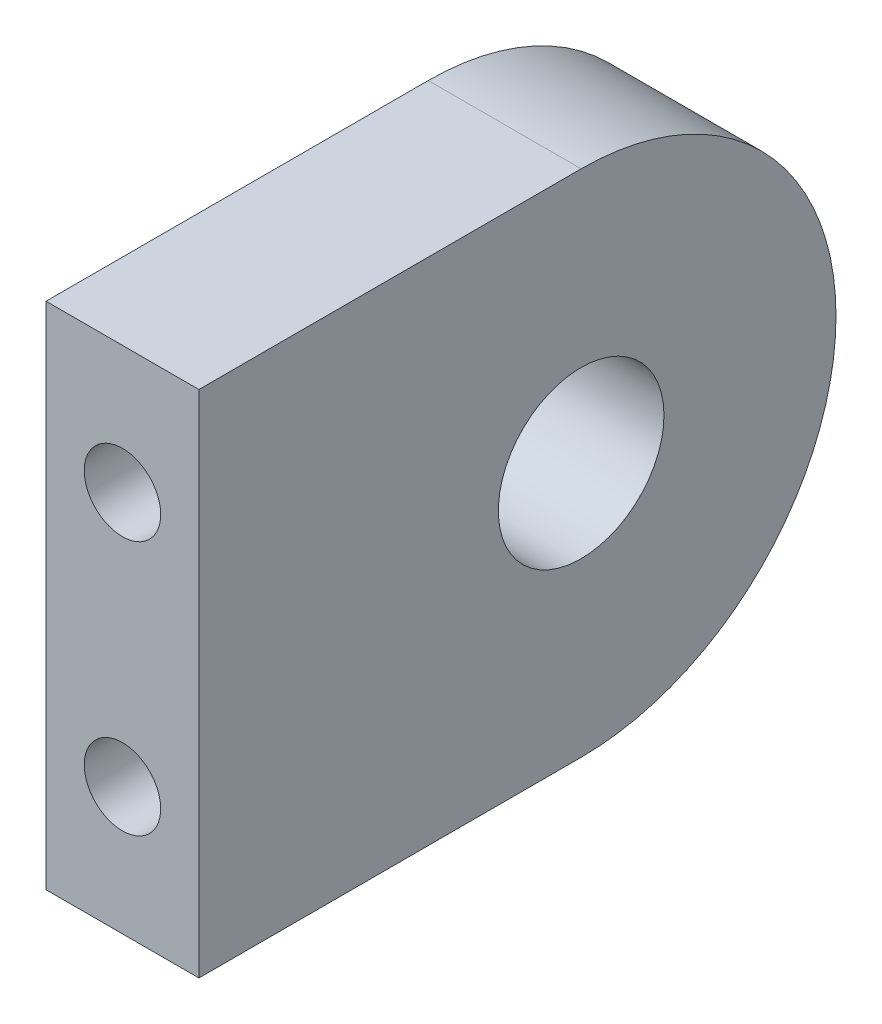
from build123d import *

# Parameters (mm, degrees)
SKETCH1_R                   = 3.25
EXTRUDE1_DEPTH              = 6
M3_TAPPED_HOLE1_D           = 2.5
M3_TAPPED_HOLE1_DEPTH       = 10
M3_TAPPED_HOLE1_CBORE_D     = 3
M3_TAPPED_HOLE1_CBORE_DEPTH = 6
M3_TAPPED_HOLE1_TIP         = 0.751075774


with BuildPart() as part:
    # Sketch1 → Extrude1 (new body)
    with BuildSketch(Plane(origin=(0, 0, 0), x_dir=(0, 0, -1), z_dir=(1, 0, 0))):
        with BuildLine():
            Line((0, 0), (15, 0))
            ThreePointArc((15, 0), (25, 10), (15, 20))
            Line((15, 20), (0, 20))
            Line((0, 20), (0, 0))
        make_face()
        with Locations((15, 10)):
            Circle(SKETCH1_R, mode=Mode.SUBTRACT)
    extrude(amount=EXTRUDE1_DEPTH)

    # M3 Tapped Hole1
    with Locations(Plane(origin=(3, 15, 0), x_dir=(0, 1, 0), z_dir=(0, 0, 1))):
        with Locations((0, 0), (-10, 0)):
            CounterBoreHole(M3_TAPPED_HOLE1_D / 2, M3_TAPPED_HOLE1_CBORE_D / 2, M3_TAPPED_HOLE1_CBORE_DEPTH, depth=M3_TAPPED_HOLE1_DEPTH)
            with Locations((0, 0, -(M3_TAPPED_HOLE1_DEPTH + M3_TAPPED_HOLE1_TIP / 2))):  # 118° drill point
                Cone(0, M3_TAPPED_HOLE1_D / 2, M3_TAPPED_HOLE1_TIP, mode=Mode.SUBTRACT)


solid = part.part
